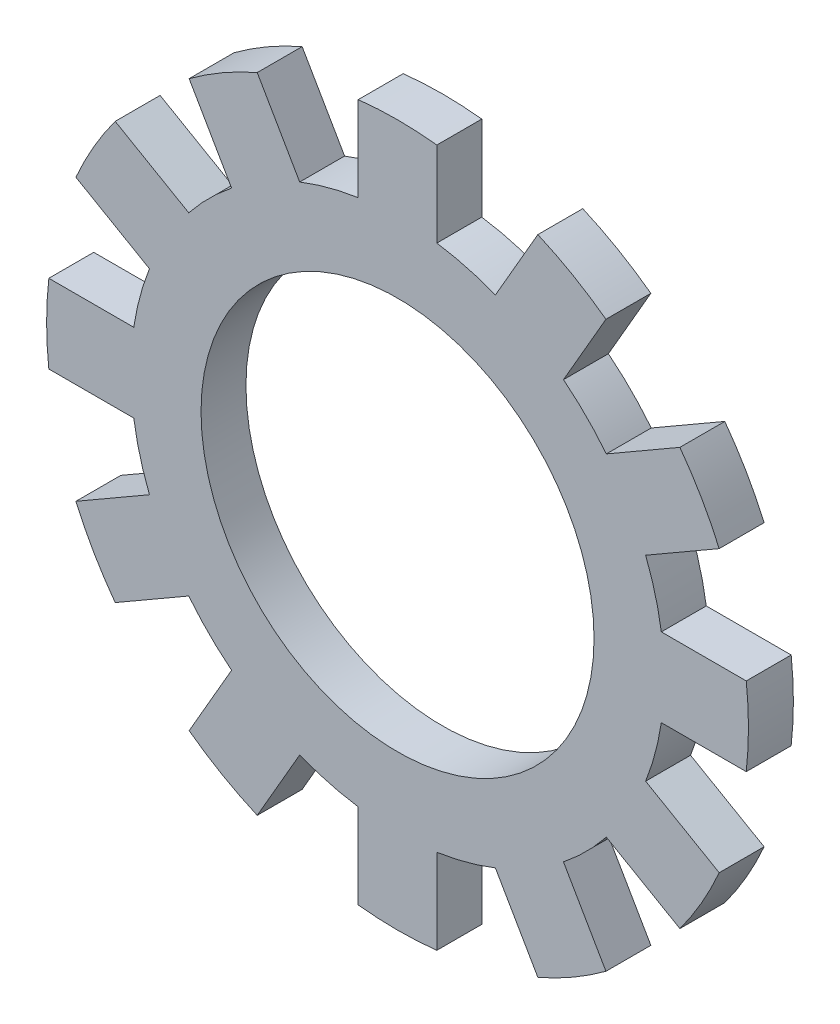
from build123d import *

# Parameters (mm, degrees)
SKETCH1_R                 = 4.75
SKETCH1_R_2               = 3.5
BOSS_EXTRUDE1_DEPTH       = 0.4
BOSS_EXTRUDE2_DEPTH       = 0.4
CIRPATTERN2_COUNT         = 12
CIRPATTERN2_COPY_1_DEPTH  = 0.4
CIRPATTERN2_COPY_2_DEPTH  = 0.4
CIRPATTERN2_COPY_3_DEPTH  = 0.4
CIRPATTERN2_COPY_4_DEPTH  = 0.4
CIRPATTERN2_COPY_5_DEPTH  = 0.4
CIRPATTERN2_COPY_6_DEPTH  = 0.4
CIRPATTERN2_COPY_7_DEPTH  = 0.4
CIRPATTERN2_COPY_8_DEPTH  = 0.4
CIRPATTERN2_COPY_9_DEPTH  = 0.4
CIRPATTERN2_COPY_10_DEPTH = 0.4
CIRPATTERN2_COPY_11_DEPTH = 0.4


with BuildPart() as part:
    # Sketch1 → Boss-Extrude1 (new, symmetric)
    with BuildSketch(Plane.XY):
        Circle(SKETCH1_R)
        Circle(SKETCH1_R_2, mode=Mode.SUBTRACT)
    extrude(amount=BOSS_EXTRUDE1_DEPTH, both=True)

    # Sketch3 → Boss-Extrude2 (add, symmetric)
    with BuildSketch(Plane.XY):
        with BuildLine():
            Line((-0.7, 6.210676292), (-0.7, 4.698137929))
            ThreePointArc((-0.7, 4.698137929), (-0.350959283, 4.737016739), (0, 4.75))
            Line((0, 4.75), (0, 6.25))
            ThreePointArc((0, 6.25), (-0.350551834, 6.240161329), (-0.7, 6.210676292))
        make_face()
    boss_extrude2 = extrude(amount=BOSS_EXTRUDE2_DEPTH, both=True)

    # Mirror1: Boss-Extrude2 across plane
    add(boss_extrude2.mirror(Plane(origin=(0, 0, 0), x_dir=(0, 0, 1), z_dir=(1, 0, 0))))

    # CirPattern2: Boss-Extrude2 ×12 about axis
    cirpattern2_axis = Axis((0, 0, 0), (0, 0, 1))
    for i in range(1, CIRPATTERN2_COUNT):
        add(boss_extrude2.rotate(cirpattern2_axis, i * 360 / CIRPATTERN2_COUNT))

    # CirPattern2 copy 1 sketch → CirPattern2 copy 1 (add, symmetric)
    with BuildSketch(Plane(origin=(0, 0, 0), x_dir=(-0.8660254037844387, -0.49999999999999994, 0), z_dir=(0, 0, 1))):
        with BuildLine():
            Line((-0.7, -6.210676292), (-0.7, -4.698137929))
            ThreePointArc((-0.7, -4.698137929), (-0.350959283, -4.737016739), (0, -4.75))
            Line((0, -4.75), (0, -6.25))
            ThreePointArc((0, -6.25), (-0.350551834, -6.240161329), (-0.7, -6.210676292))
        make_face()
    extrude(amount=CIRPATTERN2_COPY_1_DEPTH, both=True)

    # CirPattern2 copy 2 sketch → CirPattern2 copy 2 (add, symmetric)
    with BuildSketch(Plane(origin=(0, 0, 0), x_dir=(-0.5000000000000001, -0.8660254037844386, 0), z_dir=(0, 0, 1))):
        with BuildLine():
            Line((-0.7, -6.210676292), (-0.7, -4.698137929))
            ThreePointArc((-0.7, -4.698137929), (-0.350959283, -4.737016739), (0, -4.75))
            Line((0, -4.75), (0, -6.25))
            ThreePointArc((0, -6.25), (-0.350551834, -6.240161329), (-0.7, -6.210676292))
        make_face()
    extrude(amount=CIRPATTERN2_COPY_2_DEPTH, both=True)

    # CirPattern2 copy 3 sketch → CirPattern2 copy 3 (add, symmetric)
    with BuildSketch(Plane(origin=(0, 0, 0), x_dir=(0, -1, 0), z_dir=(0, 0, 1))):
        with BuildLine():
            Line((-0.7, -6.210676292), (-0.7, -4.698137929))
            ThreePointArc((-0.7, -4.698137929), (-0.350959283, -4.737016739), (0, -4.75))
            Line((0, -4.75), (0, -6.25))
            ThreePointArc((0, -6.25), (-0.350551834, -6.240161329), (-0.7, -6.210676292))
        make_face()
    extrude(amount=CIRPATTERN2_COPY_3_DEPTH, both=True)

    # CirPattern2 copy 4 sketch → CirPattern2 copy 4 (add, symmetric)
    with BuildSketch(Plane(origin=(0, 0, 0), x_dir=(0.4999999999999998, -0.8660254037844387, 0), z_dir=(0, 0, 1))):
        with BuildLine():
            Line((-0.7, -6.210676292), (-0.7, -4.698137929))
            ThreePointArc((-0.7, -4.698137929), (-0.350959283, -4.737016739), (0, -4.75))
            Line((0, -4.75), (0, -6.25))
            ThreePointArc((0, -6.25), (-0.350551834, -6.240161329), (-0.7, -6.210676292))
        make_face()
    extrude(amount=CIRPATTERN2_COPY_4_DEPTH, both=True)

    # CirPattern2 copy 5 sketch → CirPattern2 copy 5 (add, symmetric)
    with BuildSketch(Plane(origin=(0, 0, 0), x_dir=(0.8660254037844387, -0.49999999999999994, 0), z_dir=(0, 0, 1))):
        with BuildLine():
            Line((-0.7, -6.210676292), (-0.7, -4.698137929))
            ThreePointArc((-0.7, -4.698137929), (-0.350959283, -4.737016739), (0, -4.75))
            Line((0, -4.75), (0, -6.25))
            ThreePointArc((0, -6.25), (-0.350551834, -6.240161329), (-0.7, -6.210676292))
        make_face()
    extrude(amount=CIRPATTERN2_COPY_5_DEPTH, both=True)

    # CirPattern2 copy 6 sketch → CirPattern2 copy 6 (add, symmetric)
    with BuildSketch(Plane.XY):
        with BuildLine():
            Line((-0.7, -6.210676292), (-0.7, -4.698137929))
            ThreePointArc((-0.7, -4.698137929), (-0.350959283, -4.737016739), (0, -4.75))
            Line((0, -4.75), (0, -6.25))
            ThreePointArc((0, -6.25), (-0.350551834, -6.240161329), (-0.7, -6.210676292))
        make_face()
    extrude(amount=CIRPATTERN2_COPY_6_DEPTH, both=True)

    # CirPattern2 copy 7 sketch → CirPattern2 copy 7 (add, symmetric)
    with BuildSketch(Plane(origin=(0, 0, 0), x_dir=(0.8660254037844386, 0.5000000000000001, 0), z_dir=(0, 0, 1))):
        with BuildLine():
            Line((-0.7, -6.210676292), (-0.7, -4.698137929))
            ThreePointArc((-0.7, -4.698137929), (-0.350959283, -4.737016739), (0, -4.75))
            Line((0, -4.75), (0, -6.25))
            ThreePointArc((0, -6.25), (-0.350551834, -6.240161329), (-0.7, -6.210676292))
        make_face()
    extrude(amount=CIRPATTERN2_COPY_7_DEPTH, both=True)

    # CirPattern2 copy 8 sketch → CirPattern2 copy 8 (add, symmetric)
    with BuildSketch(Plane(origin=(0, 0, 0), x_dir=(0.5000000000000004, 0.8660254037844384, 0), z_dir=(0, 0, 1))):
        with BuildLine():
            Line((-0.7, -6.210676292), (-0.7, -4.698137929))
            ThreePointArc((-0.7, -4.698137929), (-0.350959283, -4.737016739), (0, -4.75))
            Line((0, -4.75), (0, -6.25))
            ThreePointArc((0, -6.25), (-0.350551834, -6.240161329), (-0.7, -6.210676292))
        make_face()
    extrude(amount=CIRPATTERN2_COPY_8_DEPTH, both=True)

    # CirPattern2 copy 9 sketch → CirPattern2 copy 9 (add, symmetric)
    with BuildSketch(Plane(origin=(0, 0, 0), x_dir=(0, 1, 0), z_dir=(0, 0, 1))):
        with BuildLine():
            Line((-0.7, -6.210676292), (-0.7, -4.698137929))
            ThreePointArc((-0.7, -4.698137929), (-0.350959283, -4.737016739), (0, -4.75))
            Line((0, -4.75), (0, -6.25))
            ThreePointArc((0, -6.25), (-0.350551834, -6.240161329), (-0.7, -6.210676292))
        make_face()
    extrude(amount=CIRPATTERN2_COPY_9_DEPTH, both=True)

    # CirPattern2 copy 10 sketch → CirPattern2 copy 10 (add, symmetric)
    with BuildSketch(Plane(origin=(0, 0, 0), x_dir=(-0.5000000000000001, 0.8660254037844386, 0), z_dir=(0, 0, 1))):
        with BuildLine():
            Line((-0.7, -6.210676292), (-0.7, -4.698137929))
            ThreePointArc((-0.7, -4.698137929), (-0.350959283, -4.737016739), (0, -4.75))
            Line((0, -4.75), (0, -6.25))
            ThreePointArc((0, -6.25), (-0.350551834, -6.240161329), (-0.7, -6.210676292))
        make_face()
    extrude(amount=CIRPATTERN2_COPY_10_DEPTH, both=True)

    # CirPattern2 copy 11 sketch → CirPattern2 copy 11 (add, symmetric)
    with BuildSketch(Plane(origin=(0, 0, 0), x_dir=(-0.8660254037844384, 0.5000000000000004, 0), z_dir=(0, 0, 1))):
        with BuildLine():
            Line((-0.7, -6.210676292), (-0.7, -4.698137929))
            ThreePointArc((-0.7, -4.698137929), (-0.350959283, -4.737016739), (0, -4.75))
            Line((0, -4.75), (0, -6.25))
            ThreePointArc((0, -6.25), (-0.350551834, -6.240161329), (-0.7, -6.210676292))
        make_face()
    extrude(amount=CIRPATTERN2_COPY_11_DEPTH, both=True)


solid = part.part
